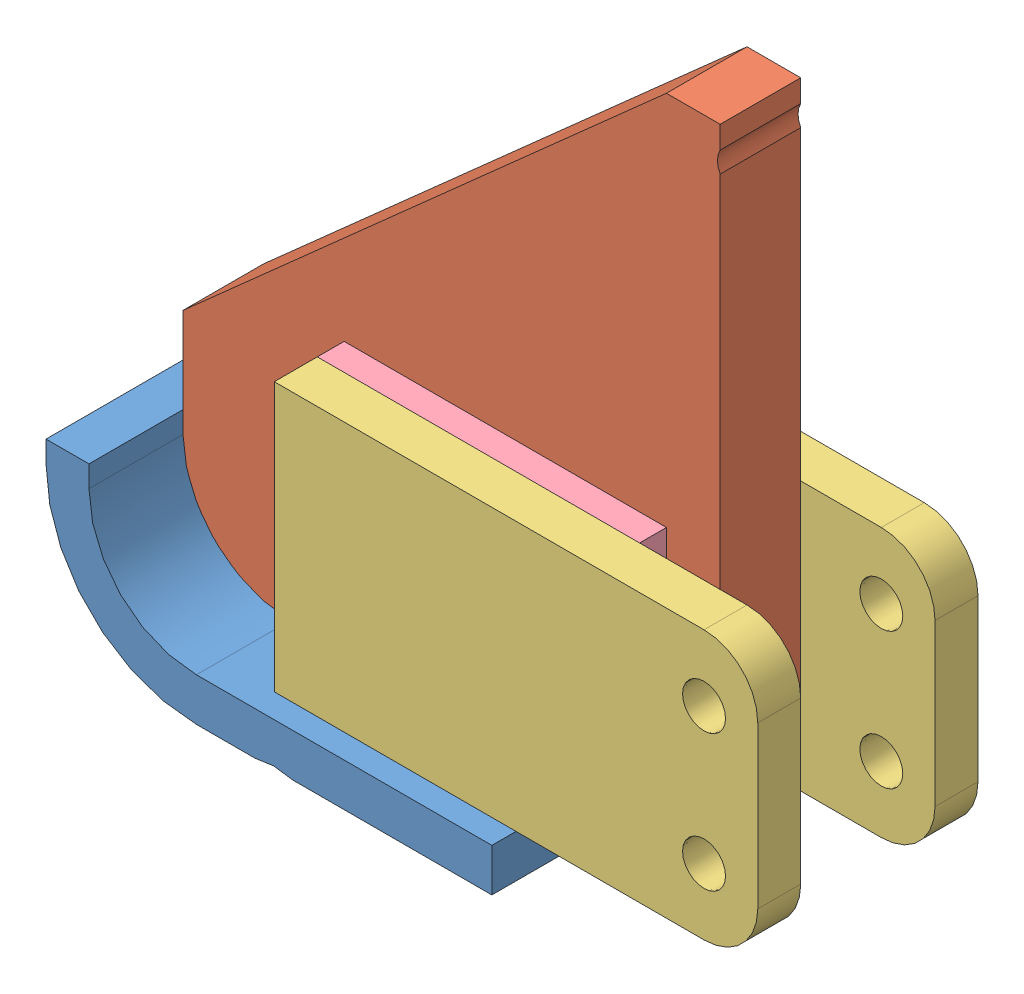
SolidWorks assembly ergot complet cosmos.SLDASM, configuration Défaut (file format 3100). Lengths in mm.
Overall size (142.73 272.53 50).
6 component instances, 4 part files, 18 mates.
Components (placement in the parent):
- patin cosmos-1: patin cosmos.SLDPRT [Défaut] at (-14.826 37.4192 -25) size (83 32 50)
- equerre cosmos-1: equerre cosmos.SLDPRT [Défaut] at (10.174 45.4192 -7.5) size (100 120 15)
- liaison chaine-1: liaison chaine.SLDPRT [Défaut] at (-59.826 95.4192 12.5) size (90 50 8)
- entretoise-1: entretoise.SLDPRT [Défaut] at (-59.826 95.4192 7.5) size (60 50 5)
- liaison chaine-2: liaison chaine.SLDPRT [Défaut] at (-59.826 95.4192 -20.5) size (90 50 8)
- entretoise-2: entretoise.SLDPRT [Défaut] at (-59.826 95.4192 -12.5) size (60 50 5)
Mates (geometry in assembly coordinates):
- Coïncidente1: coincident anti-aligned: plane of patin cosmos-1 through (-14.826 45.4192 25) normal (0 1 0); plane of equerre cosmos-1 through (-69.826 45.4192 7.5) normal (0 -1 0)
- Distance1: distance = 17.5 mm aligned: plane of patin cosmos-1 through (-69.826 65.4192 25) normal (0 0 1); plane of equerre cosmos-1 through (-69.826 65.4192 7.5) normal (0 0 1)
- Coaxial1: concentric aligned: cylinder of patin cosmos-1; cylinder of equerre cosmos-1
- Coïncidente2: coincident anti-aligned: plane of entretoise-1 through (-59.826 45.4192 7.5) normal (0 0 -1); plane of equerre cosmos-1 through (-69.826 65.4192 7.5) normal (0 0 1)
- Coïncidente3: coincident anti-aligned: plane of patin cosmos-1 through (-14.826 45.4192 25) normal (0 1 0); plane of entretoise-1 through (-59.826 45.4192 12.5) normal (0 -1 0)
- Coïncidente9: coincident anti-aligned: plane of entretoise-2 through (-59.826 45.4192 -7.5) normal (0 0 1); plane of equerre cosmos-1 through (-69.826 65.4192 -7.5) normal (0 0 -1)
- Coïncidente10: coincident anti-aligned: plane of patin cosmos-1 through (-14.826 45.4192 25) normal (0 1 0); plane of entretoise-2 through (-59.826 45.4192 -7.5) normal (0 -1 0)
- Distance5: distance = 10 mm aligned: plane of equerre cosmos-1 through (10.174 165.4192 7.5) normal (1 0 0); plane of entretoise-2 through (0.174 95.4192 -7.5) normal (1 0 0)
- Coïncidente11: coincident anti-aligned: plane of patin cosmos-1 through (-14.826 45.4192 25) normal (0 1 0); plane of liaison chaine-1 through (-59.826 45.4192 20.5) normal (0 -1 0)
- Coïncidente12: coincident anti-aligned: plane of entretoise-1 through (-59.826 45.4192 12.5) normal (0 0 1); plane of liaison chaine-1 through (20.174 55.4192 12.5) normal (0 0 -1)
- Distance6: distance = 20 mm aligned: plane of equerre cosmos-1 through (10.174 165.4192 7.5) normal (1 0 0); plane of liaison chaine-1 through (30.174 85.4192 20.5) normal (1 0 0)
- Coïncidente13: coincident anti-aligned: plane of entretoise-2 through (-59.826 45.4192 -12.5) normal (0 0 -1); plane of liaison chaine-2 through (20.174 55.4192 -12.5) normal (0 0 1)
- Coïncidente14: coincident anti-aligned: plane of patin cosmos-1 through (-14.826 45.4192 25) normal (0 1 0); plane of liaison chaine-2 through (-59.826 45.4192 -12.5) normal (0 -1 0)
- Coïncidente15: coincident aligned: plane of liaison chaine-1 through (30.174 85.4192 20.5) normal (1 0 0); plane of liaison chaine-2 through (30.174 85.4192 -12.5) normal (1 0 0)
- Distance7: distance = 10 mm aligned: unknown of equerre cosmos-1; unknown of entretoise-1
- Système de coordonnées2: unknown: unknown of liaison chaine-1; unknown of liaison chaine-1
- Système de coordonnées3: unknown: unknown of equerre cosmos-1; unknown of equerre cosmos-1
- Système de coordonnées4: unknown: unknown of patin cosmos-1; unknown of patin cosmos-1
